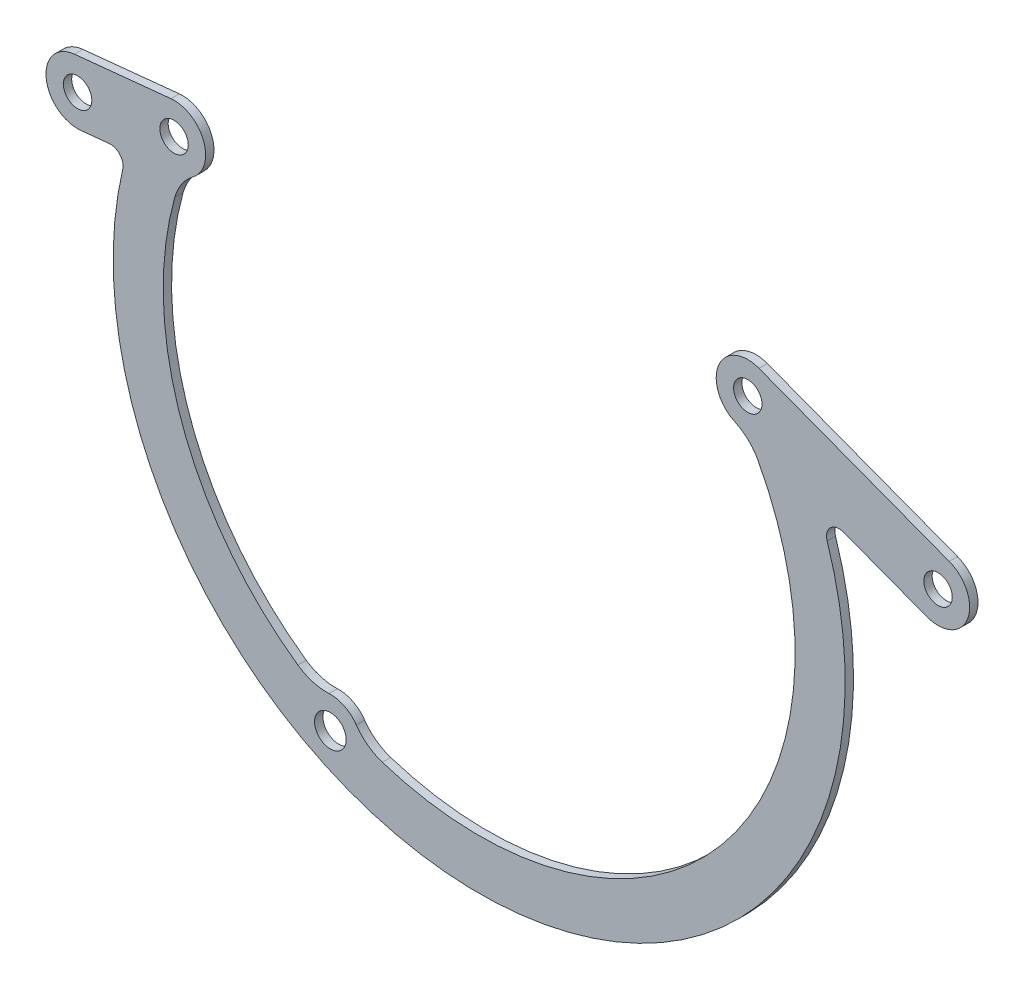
ISO-10303-21;
HEADER;
FILE_DESCRIPTION(('STEP AP214'),'2;1');
FILE_NAME('part.step','',(''),(''),'','','');
FILE_SCHEMA(('AUTOMOTIVE_DESIGN { 1 0 10303 214 1 1 1 1 }'));
ENDSEC;
DATA;
#1=APPLICATION_CONTEXT('core data for automotive mechanical design processes');
#2=APPLICATION_PROTOCOL_DEFINITION('international standard','automotive_design',2000,#1);
#3=PRODUCT_CONTEXT('',#1,'mechanical');
#4=PRODUCT('Part','Part','',(#3));
#5=PRODUCT_RELATED_PRODUCT_CATEGORY('part','',(#4));
#6=PRODUCT_DEFINITION_FORMATION('','',#4);
#7=PRODUCT_DEFINITION_CONTEXT('part definition',#1,'design');
#8=PRODUCT_DEFINITION('design','',#6,#7);
#9=PRODUCT_DEFINITION_SHAPE('','',#8);
#10=(LENGTH_UNIT() NAMED_UNIT(*) SI_UNIT(.MILLI.,.METRE.));
#11=(NAMED_UNIT(*) PLANE_ANGLE_UNIT() SI_UNIT($,.RADIAN.));
#12=(NAMED_UNIT(*) SI_UNIT($,.STERADIAN.) SOLID_ANGLE_UNIT());
#13=UNCERTAINTY_MEASURE_WITH_UNIT(LENGTH_MEASURE(1.E-05),#10,'distance_accuracy_value','');
#14=(GEOMETRIC_REPRESENTATION_CONTEXT(3) GLOBAL_UNCERTAINTY_ASSIGNED_CONTEXT((#13)) GLOBAL_UNIT_ASSIGNED_CONTEXT((#10,
#11,#12)) REPRESENTATION_CONTEXT('',''));
#15=CARTESIAN_POINT('',(0.,0.,0.));
#16=DIRECTION('',(0.,0.,1.));
#17=DIRECTION('',(1.,0.,0.));
#18=AXIS2_PLACEMENT_3D('',#15,#16,#17);
#19=CARTESIAN_POINT('',(0.,0.,1.9812));
#20=DIRECTION('',(0.,0.,1.));
#21=DIRECTION('',(1.,0.,0.));
#22=AXIS2_PLACEMENT_3D('',#19,#20,#21);
#23=PLANE('',#22);
#24=CARTESIAN_POINT('',(-144.25,-101.25,1.9812));
#25=DIRECTION('',(0.,0.,1.));
#26=DIRECTION('',(1.,0.,0.));
#27=AXIS2_PLACEMENT_3D('',#24,#25,#26);
#28=CIRCLE('',#27,3.75000000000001);
#29=CARTESIAN_POINT('',(-140.5,-101.25,1.9812));
#30=VERTEX_POINT('',#29);
#31=EDGE_CURVE('E260',#30,#30,#28,.T.);
#32=ORIENTED_EDGE('',*,*,#31,.F.);
#33=EDGE_LOOP('',(#32));
#34=FACE_BOUND('',#33,.T.);
#35=CARTESIAN_POINT('',(-45.1656581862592,17.1076495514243,1.9812));
#36=DIRECTION('',(0.,0.,1.));
#37=DIRECTION('',(1.,0.,0.));
#38=AXIS2_PLACEMENT_3D('',#35,#36,#37);
#39=CIRCLE('',#38,3.375);
#40=CARTESIAN_POINT('',(-41.7906581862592,17.1076495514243,1.9812));
#41=VERTEX_POINT('',#40);
#42=EDGE_CURVE('E295',#41,#41,#39,.T.);
#43=ORIENTED_EDGE('',*,*,#42,.F.);
#44=EDGE_LOOP('',(#43));
#45=FACE_BOUND('',#44,.T.);
#46=CARTESIAN_POINT('',(0.,0.,1.9812));
#47=DIRECTION('',(0.,0.,1.));
#48=DIRECTION('',(1.,0.,0.));
#49=AXIS2_PLACEMENT_3D('',#46,#47,#48);
#50=CIRCLE('',#49,3.375);
#51=CARTESIAN_POINT('',(3.375,0.,1.9812));
#52=VERTEX_POINT('',#51);
#53=EDGE_CURVE('E298',#52,#52,#50,.T.);
#54=ORIENTED_EDGE('',*,*,#53,.F.);
#55=EDGE_LOOP('',(#54));
#56=FACE_BOUND('',#55,.T.);
#57=CARTESIAN_POINT('',(-181.353320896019,2.30357829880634,1.9812));
#58=DIRECTION('',(0.,0.,1.));
#59=DIRECTION('',(1.,0.,0.));
#60=AXIS2_PLACEMENT_3D('',#57,#58,#59);
#61=CIRCLE('',#60,3.37499999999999);
#62=CARTESIAN_POINT('',(-177.978320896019,2.30357829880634,1.9812));
#63=VERTEX_POINT('',#62);
#64=EDGE_CURVE('E301',#63,#63,#61,.T.);
#65=ORIENTED_EDGE('',*,*,#64,.F.);
#66=EDGE_LOOP('',(#65));
#67=FACE_BOUND('',#66,.T.);
#68=CARTESIAN_POINT('',(-204.25,0.,1.9812));
#69=DIRECTION('',(0.,0.,1.));
#70=DIRECTION('',(1.,0.,0.));
#71=AXIS2_PLACEMENT_3D('',#68,#69,#70);
#72=CIRCLE('',#71,3.37499999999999);
#73=CARTESIAN_POINT('',(-200.875,0.,1.9812));
#74=VERTEX_POINT('',#73);
#75=EDGE_CURVE('E304',#74,#74,#72,.T.);
#76=ORIENTED_EDGE('',*,*,#75,.F.);
#77=EDGE_LOOP('',(#76));
#78=FACE_BOUND('',#77,.T.);
#79=CARTESIAN_POINT('',(-169.615597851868,-13.2680580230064,1.9812));
#80=DIRECTION('',(0.,0.,1.));
#81=DIRECTION('',(1.,0.,0.));
#82=AXIS2_PLACEMENT_3D('',#79,#80,#81);
#83=CIRCLE('',#82,12.);
#84=CARTESIAN_POINT('',(-181.175718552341,-10.0488019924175,1.9812));
#85=VERTEX_POINT('',#84);
#86=CARTESIAN_POINT('',(-176.838812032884,-3.68551259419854,1.9812));
#87=VERTEX_POINT('',#86);
#88=EDGE_CURVE('E221',#85,#87,#83,.F.);
#89=ORIENTED_EDGE('',*,*,#88,.T.);
#90=CARTESIAN_POINT('',(-181.353320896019,2.30357829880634,1.9812));
#91=DIRECTION('',(0.,0.,1.));
#92=DIRECTION('',(1.,0.,0.));
#93=AXIS2_PLACEMENT_3D('',#90,#91,#92);
#94=CIRCLE('',#93,7.5);
#95=CARTESIAN_POINT('',(-182.10408734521,9.76590700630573,1.9812));
#96=VERTEX_POINT('',#95);
#97=EDGE_CURVE('E273',#87,#96,#94,.T.);
#98=ORIENTED_EDGE('',*,*,#97,.T.);
#99=DIRECTION('',(0.994977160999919,0.100102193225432,0.));
#100=VECTOR('',#99,1.);
#101=CARTESIAN_POINT('',(-2.79744317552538,27.805505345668,1.9812));
#102=LINE('',#101,#100);
#103=CARTESIAN_POINT('',(-205.000766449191,7.46232870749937,1.9812));
#104=VERTEX_POINT('',#103);
#105=EDGE_CURVE('E275',#104,#96,#102,.T.);
#106=ORIENTED_EDGE('',*,*,#105,.F.);
#107=CARTESIAN_POINT('',(-204.25,0.,1.9812));
#108=DIRECTION('',(0.,0.,1.));
#109=DIRECTION('',(1.,0.,0.));
#110=AXIS2_PLACEMENT_3D('',#107,#108,#109);
#111=CIRCLE('',#110,7.5);
#112=CARTESIAN_POINT('',(-203.499233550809,-7.46232870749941,1.9812));
#113=VERTEX_POINT('',#112);
#114=EDGE_CURVE('E279',#104,#113,#111,.T.);
#115=ORIENTED_EDGE('',*,*,#114,.T.);
#116=DIRECTION('',(0.994977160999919,0.100102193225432,0.));
#117=VECTOR('',#116,1.);
#118=CARTESIAN_POINT('',(-1.2959102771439,12.8808479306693,1.9812));
#119=LINE('',#118,#117);
#120=CARTESIAN_POINT('',(-196.754027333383,-6.78371017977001,1.9812));
#121=VERTEX_POINT('',#120);
#122=EDGE_CURVE('E281',#113,#121,#119,.T.);
#123=ORIENTED_EDGE('',*,*,#122,.T.);
#124=CARTESIAN_POINT('',(-196.453720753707,-9.76864166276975,1.9812));
#125=DIRECTION('',(0.,0.,1.));
#126=DIRECTION('',(1.,0.,0.));
#127=AXIS2_PLACEMENT_3D('',#124,#125,#126);
#128=CIRCLE('',#127,3.);
#129=CARTESIAN_POINT('',(-193.532028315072,-10.4496066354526,1.9812));
#130=VERTEX_POINT('',#129);
#131=EDGE_CURVE('E366',#121,#130,#128,.F.);
#132=ORIENTED_EDGE('',*,*,#131,.T.);
#133=CARTESIAN_POINT('',(-108.924964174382,-30.1691521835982,1.9812));
#134=DIRECTION('',(0.,0.,1.));
#135=DIRECTION('',(1.,0.,0.));
#136=AXIS2_PLACEMENT_3D('',#133,#134,#135);
#137=CIRCLE('',#136,86.8747131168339);
#138=CARTESIAN_POINT('',(-26.3202312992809,-3.26796474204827,1.9812));
#139=VERTEX_POINT('',#138);
#140=EDGE_CURVE('E284',#130,#139,#137,.T.);
#141=ORIENTED_EDGE('',*,*,#140,.T.);
#142=CARTESIAN_POINT('',(-23.4676843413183,-2.33899980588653,1.9812));
#143=DIRECTION('',(0.,0.,1.));
#144=DIRECTION('',(1.,0.,0.));
#145=AXIS2_PLACEMENT_3D('',#142,#143,#144);
#146=CIRCLE('',#145,3.);
#147=CARTESIAN_POINT('',(-22.4050332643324,0.466489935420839,1.9812));
#148=VERTEX_POINT('',#147);
#149=EDGE_CURVE('E12',#139,#148,#146,.F.);
#150=ORIENTED_EDGE('',*,*,#149,.T.);
#151=DIRECTION('',(0.935163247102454,-0.354217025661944,0.));
#152=VECTOR('',#151,1.);
#153=CARTESIAN_POINT('',(-2.65662769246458,-7.01372435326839,1.9812));
#154=LINE('',#153,#152);
#155=CARTESIAN_POINT('',(-2.65662769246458,-7.01372435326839,1.9812));
#156=VERTEX_POINT('',#155);
#157=EDGE_CURVE('E286',#148,#156,#154,.T.);
#158=ORIENTED_EDGE('',*,*,#157,.T.);
#159=CARTESIAN_POINT('',(0.,0.,1.9812));
#160=DIRECTION('',(0.,0.,1.));
#161=DIRECTION('',(1.,0.,0.));
#162=AXIS2_PLACEMENT_3D('',#159,#160,#161);
#163=CIRCLE('',#162,7.49999999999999);
#164=CARTESIAN_POINT('',(2.65662769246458,7.0137243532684,1.9812));
#165=VERTEX_POINT('',#164);
#166=EDGE_CURVE('E288',#156,#165,#163,.T.);
#167=ORIENTED_EDGE('',*,*,#166,.T.);
#168=DIRECTION('',(0.935163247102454,-0.354217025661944,0.));
#169=VECTOR('',#168,1.);
#170=CARTESIAN_POINT('',(2.65662769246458,7.0137243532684,1.9812));
#171=LINE('',#170,#169);
#172=CARTESIAN_POINT('',(-42.5090304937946,24.1213739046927,1.9812));
#173=VERTEX_POINT('',#172);
#174=EDGE_CURVE('E290',#173,#165,#171,.T.);
#175=ORIENTED_EDGE('',*,*,#174,.F.);
#176=CARTESIAN_POINT('',(-45.1656581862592,17.1076495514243,1.9812));
#177=DIRECTION('',(0.,0.,1.));
#178=DIRECTION('',(1.,0.,0.));
#179=AXIS2_PLACEMENT_3D('',#176,#177,#178);
#180=CIRCLE('',#179,7.49999999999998);
#181=CARTESIAN_POINT('',(-48.2878584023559,10.2884218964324,1.9812));
#182=VERTEX_POINT('',#181);
#183=EDGE_CURVE('E293',#173,#182,#180,.T.);
#184=ORIENTED_EDGE('',*,*,#183,.T.);
#185=CARTESIAN_POINT('',(-53.2833787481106,-0.62234235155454,1.9812));
#186=DIRECTION('',(0.,0.,1.));
#187=DIRECTION('',(1.,0.,0.));
#188=AXIS2_PLACEMENT_3D('',#185,#186,#187);
#189=CIRCLE('',#188,12.);
#190=CARTESIAN_POINT('',(-42.6849815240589,5.0056214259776,1.9812));
#191=VERTEX_POINT('',#190);
#192=EDGE_CURVE('E232',#182,#191,#189,.F.);
#193=ORIENTED_EDGE('',*,*,#192,.T.);
#194=CARTESIAN_POINT('',(-108.924964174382,-30.1691521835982,1.9812));
#195=DIRECTION('',(0.,0.,1.));
#196=DIRECTION('',(1.,0.,0.));
#197=AXIS2_PLACEMENT_3D('',#194,#195,#196);
#198=CIRCLE('',#197,75.);
#199=CARTESIAN_POINT('',(-131.900317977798,-101.563361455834,1.9812));
#200=VERTEX_POINT('',#199);
#201=EDGE_CURVE('E240',#200,#191,#198,.T.);
#202=ORIENTED_EDGE('',*,*,#201,.F.);
#203=CARTESIAN_POINT('',(-128.224261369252,-90.1402879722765,1.9812));
#204=DIRECTION('',(0.,0.,1.));
#205=DIRECTION('',(1.,0.,0.));
#206=AXIS2_PLACEMENT_3D('',#203,#204,#205);
#207=CIRCLE('',#206,12.);
#208=CARTESIAN_POINT('',(-138.086254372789,-96.9770338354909,1.9812));
#209=VERTEX_POINT('',#208);
#210=EDGE_CURVE('E253',#209,#200,#207,.T.);
#211=ORIENTED_EDGE('',*,*,#210,.F.);
#212=CARTESIAN_POINT('',(-144.25,-101.25,1.9812));
#213=DIRECTION('',(0.,0.,1.));
#214=DIRECTION('',(1.,0.,0.));
#215=AXIS2_PLACEMENT_3D('',#212,#213,#214);
#216=CIRCLE('',#215,7.49999999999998);
#217=CARTESIAN_POINT('',(-144.566251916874,-93.7566706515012,1.9812));
#218=VERTEX_POINT('',#217);
#219=EDGE_CURVE('E251',#209,#218,#216,.T.);
#220=ORIENTED_EDGE('',*,*,#219,.T.);
#221=CARTESIAN_POINT('',(-145.072254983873,-81.7673436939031,1.9812));
#222=DIRECTION('',(0.,0.,1.));
#223=DIRECTION('',(1.,0.,0.));
#224=AXIS2_PLACEMENT_3D('',#221,#222,#223);
#225=CIRCLE('',#224,12.);
#226=CARTESIAN_POINT('',(-151.957453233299,-91.5955706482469,1.9812));
#227=VERTEX_POINT('',#226);
#228=EDGE_CURVE('E224',#227,#218,#225,.T.);
#229=ORIENTED_EDGE('',*,*,#228,.F.);
#230=CARTESIAN_POINT('',(-108.924964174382,-30.1691521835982,1.9812));
#231=DIRECTION('',(0.,0.,1.));
#232=DIRECTION('',(1.,0.,0.));
#233=AXIS2_PLACEMENT_3D('',#230,#231,#232);
#234=CIRCLE('',#233,75.);
#235=EDGE_CURVE('E204',#85,#227,#234,.T.);
#236=ORIENTED_EDGE('',*,*,#235,.F.);
#237=EDGE_LOOP('',(#89,#98,#106,#115,#123,#132,#141,#150,#158,#167,#175,#184,#193,#202,#211,
#220,#229,#236));
#238=FACE_BOUND('',#237,.T.);
#239=ADVANCED_FACE('F73',(#34,#45,#56,#67,#78,#238),#23,.T.);
#240=CARTESIAN_POINT('',(0.,0.,0.));
#241=DIRECTION('',(0.,0.,1.));
#242=DIRECTION('',(1.,0.,0.));
#243=AXIS2_PLACEMENT_3D('',#240,#241,#242);
#244=PLANE('',#243);
#245=CARTESIAN_POINT('',(-144.25,-101.25,0.));
#246=DIRECTION('',(0.,0.,1.));
#247=DIRECTION('',(1.,0.,0.));
#248=AXIS2_PLACEMENT_3D('',#245,#246,#247);
#249=CIRCLE('',#248,3.75000000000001);
#250=CARTESIAN_POINT('',(-140.5,-101.25,0.));
#251=VERTEX_POINT('',#250);
#252=EDGE_CURVE('E267',#251,#251,#249,.T.);
#253=ORIENTED_EDGE('',*,*,#252,.T.);
#254=EDGE_LOOP('',(#253));
#255=FACE_BOUND('',#254,.T.);
#256=CARTESIAN_POINT('',(-45.1656581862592,17.1076495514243,0.));
#257=DIRECTION('',(0.,0.,1.));
#258=DIRECTION('',(1.,0.,0.));
#259=AXIS2_PLACEMENT_3D('',#256,#257,#258);
#260=CIRCLE('',#259,3.375);
#261=CARTESIAN_POINT('',(-41.7906581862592,17.1076495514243,0.));
#262=VERTEX_POINT('',#261);
#263=EDGE_CURVE('E331',#262,#262,#260,.T.);
#264=ORIENTED_EDGE('',*,*,#263,.T.);
#265=EDGE_LOOP('',(#264));
#266=FACE_BOUND('',#265,.T.);
#267=CARTESIAN_POINT('',(0.,0.,0.));
#268=DIRECTION('',(0.,0.,1.));
#269=DIRECTION('',(1.,0.,0.));
#270=AXIS2_PLACEMENT_3D('',#267,#268,#269);
#271=CIRCLE('',#270,3.375);
#272=CARTESIAN_POINT('',(3.375,0.,0.));
#273=VERTEX_POINT('',#272);
#274=EDGE_CURVE('E334',#273,#273,#271,.T.);
#275=ORIENTED_EDGE('',*,*,#274,.T.);
#276=EDGE_LOOP('',(#275));
#277=FACE_BOUND('',#276,.T.);
#278=CARTESIAN_POINT('',(-181.353320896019,2.30357829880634,0.));
#279=DIRECTION('',(0.,0.,1.));
#280=DIRECTION('',(1.,0.,0.));
#281=AXIS2_PLACEMENT_3D('',#278,#279,#280);
#282=CIRCLE('',#281,3.37499999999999);
#283=CARTESIAN_POINT('',(-177.978320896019,2.30357829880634,0.));
#284=VERTEX_POINT('',#283);
#285=EDGE_CURVE('E337',#284,#284,#282,.T.);
#286=ORIENTED_EDGE('',*,*,#285,.T.);
#287=EDGE_LOOP('',(#286));
#288=FACE_BOUND('',#287,.T.);
#289=CARTESIAN_POINT('',(-204.25,0.,0.));
#290=DIRECTION('',(0.,0.,1.));
#291=DIRECTION('',(1.,0.,0.));
#292=AXIS2_PLACEMENT_3D('',#289,#290,#291);
#293=CIRCLE('',#292,3.37499999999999);
#294=CARTESIAN_POINT('',(-200.875,0.,0.));
#295=VERTEX_POINT('',#294);
#296=EDGE_CURVE('E276',#295,#295,#293,.T.);
#297=ORIENTED_EDGE('',*,*,#296,.T.);
#298=EDGE_LOOP('',(#297));
#299=FACE_BOUND('',#298,.T.);
#300=CARTESIAN_POINT('',(-181.353320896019,2.30357829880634,0.));
#301=DIRECTION('',(0.,0.,1.));
#302=DIRECTION('',(1.,0.,0.));
#303=AXIS2_PLACEMENT_3D('',#300,#301,#302);
#304=CIRCLE('',#303,7.5);
#305=CARTESIAN_POINT('',(-176.838812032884,-3.68551259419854,0.));
#306=VERTEX_POINT('',#305);
#307=CARTESIAN_POINT('',(-182.10408734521,9.76590700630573,0.));
#308=VERTEX_POINT('',#307);
#309=EDGE_CURVE('E270',#306,#308,#304,.T.);
#310=ORIENTED_EDGE('',*,*,#309,.F.);
#311=CARTESIAN_POINT('',(-169.615597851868,-13.2680580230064,0.));
#312=DIRECTION('',(0.,0.,1.));
#313=DIRECTION('',(1.,0.,0.));
#314=AXIS2_PLACEMENT_3D('',#311,#312,#313);
#315=CIRCLE('',#314,12.);
#316=CARTESIAN_POINT('',(-181.175718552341,-10.0488019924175,0.));
#317=VERTEX_POINT('',#316);
#318=EDGE_CURVE('E209',#317,#306,#315,.F.);
#319=ORIENTED_EDGE('',*,*,#318,.F.);
#320=CARTESIAN_POINT('',(-108.924964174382,-30.1691521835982,0.));
#321=DIRECTION('',(0.,0.,1.));
#322=DIRECTION('',(1.,0.,0.));
#323=AXIS2_PLACEMENT_3D('',#320,#321,#322);
#324=CIRCLE('',#323,75.);
#325=CARTESIAN_POINT('',(-151.957453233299,-91.5955706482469,0.));
#326=VERTEX_POINT('',#325);
#327=EDGE_CURVE('E201',#317,#326,#324,.T.);
#328=ORIENTED_EDGE('',*,*,#327,.T.);
#329=CARTESIAN_POINT('',(-145.072254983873,-81.7673436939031,0.));
#330=DIRECTION('',(0.,0.,1.));
#331=DIRECTION('',(1.,0.,0.));
#332=AXIS2_PLACEMENT_3D('',#329,#330,#331);
#333=CIRCLE('',#332,12.);
#334=CARTESIAN_POINT('',(-144.566251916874,-93.7566706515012,0.));
#335=VERTEX_POINT('',#334);
#336=EDGE_CURVE('E213',#326,#335,#333,.T.);
#337=ORIENTED_EDGE('',*,*,#336,.T.);
#338=CARTESIAN_POINT('',(-144.25,-101.25,0.));
#339=DIRECTION('',(0.,0.,1.));
#340=DIRECTION('',(1.,0.,0.));
#341=AXIS2_PLACEMENT_3D('',#338,#339,#340);
#342=CIRCLE('',#341,7.49999999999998);
#343=CARTESIAN_POINT('',(-138.086254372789,-96.9770338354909,0.));
#344=VERTEX_POINT('',#343);
#345=EDGE_CURVE('E239',#344,#335,#342,.T.);
#346=ORIENTED_EDGE('',*,*,#345,.F.);
#347=CARTESIAN_POINT('',(-128.224261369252,-90.1402879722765,0.));
#348=DIRECTION('',(0.,0.,1.));
#349=DIRECTION('',(1.,0.,0.));
#350=AXIS2_PLACEMENT_3D('',#347,#348,#349);
#351=CIRCLE('',#350,12.);
#352=CARTESIAN_POINT('',(-131.900317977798,-101.563361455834,0.));
#353=VERTEX_POINT('',#352);
#354=EDGE_CURVE('E242',#344,#353,#351,.T.);
#355=ORIENTED_EDGE('',*,*,#354,.T.);
#356=CARTESIAN_POINT('',(-108.924964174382,-30.1691521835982,0.));
#357=DIRECTION('',(0.,0.,1.));
#358=DIRECTION('',(1.,0.,0.));
#359=AXIS2_PLACEMENT_3D('',#356,#357,#358);
#360=CIRCLE('',#359,75.);
#361=CARTESIAN_POINT('',(-42.6849815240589,5.0056214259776,0.));
#362=VERTEX_POINT('',#361);
#363=EDGE_CURVE('E245',#353,#362,#360,.T.);
#364=ORIENTED_EDGE('',*,*,#363,.T.);
#365=CARTESIAN_POINT('',(-53.2833787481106,-0.62234235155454,0.));
#366=DIRECTION('',(0.,0.,1.));
#367=DIRECTION('',(1.,0.,0.));
#368=AXIS2_PLACEMENT_3D('',#365,#366,#367);
#369=CIRCLE('',#368,12.);
#370=CARTESIAN_POINT('',(-48.2878584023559,10.2884218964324,0.));
#371=VERTEX_POINT('',#370);
#372=EDGE_CURVE('E237',#371,#362,#369,.F.);
#373=ORIENTED_EDGE('',*,*,#372,.F.);
#374=CARTESIAN_POINT('',(-45.1656581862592,17.1076495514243,0.));
#375=DIRECTION('',(0.,0.,1.));
#376=DIRECTION('',(1.,0.,0.));
#377=AXIS2_PLACEMENT_3D('',#374,#375,#376);
#378=CIRCLE('',#377,7.49999999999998);
#379=CARTESIAN_POINT('',(-42.5090304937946,24.1213739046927,0.));
#380=VERTEX_POINT('',#379);
#381=EDGE_CURVE('E329',#380,#371,#378,.T.);
#382=ORIENTED_EDGE('',*,*,#381,.F.);
#383=DIRECTION('',(0.935163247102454,-0.354217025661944,0.));
#384=VECTOR('',#383,1.);
#385=CARTESIAN_POINT('',(2.65662769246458,7.0137243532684,0.));
#386=LINE('',#385,#384);
#387=CARTESIAN_POINT('',(2.65662769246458,7.0137243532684,0.));
#388=VERTEX_POINT('',#387);
#389=EDGE_CURVE('E326',#380,#388,#386,.T.);
#390=ORIENTED_EDGE('',*,*,#389,.T.);
#391=CARTESIAN_POINT('',(0.,0.,0.));
#392=DIRECTION('',(0.,0.,1.));
#393=DIRECTION('',(1.,0.,0.));
#394=AXIS2_PLACEMENT_3D('',#391,#392,#393);
#395=CIRCLE('',#394,7.49999999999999);
#396=CARTESIAN_POINT('',(-2.65662769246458,-7.01372435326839,0.));
#397=VERTEX_POINT('',#396);
#398=EDGE_CURVE('E323',#397,#388,#395,.T.);
#399=ORIENTED_EDGE('',*,*,#398,.F.);
#400=DIRECTION('',(0.935163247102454,-0.354217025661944,0.));
#401=VECTOR('',#400,1.);
#402=CARTESIAN_POINT('',(-2.65662769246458,-7.01372435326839,0.));
#403=LINE('',#402,#401);
#404=CARTESIAN_POINT('',(-22.4050332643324,0.466489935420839,0.));
#405=VERTEX_POINT('',#404);
#406=EDGE_CURVE('E321',#405,#397,#403,.T.);
#407=ORIENTED_EDGE('',*,*,#406,.F.);
#408=CARTESIAN_POINT('',(-23.4676843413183,-2.33899980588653,0.));
#409=DIRECTION('',(0.,0.,1.));
#410=DIRECTION('',(1.,0.,0.));
#411=AXIS2_PLACEMENT_3D('',#408,#409,#410);
#412=CIRCLE('',#411,3.);
#413=CARTESIAN_POINT('',(-26.3202312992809,-3.26796474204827,0.));
#414=VERTEX_POINT('',#413);
#415=EDGE_CURVE('E81',#405,#414,#412,.T.);
#416=ORIENTED_EDGE('',*,*,#415,.T.);
#417=CARTESIAN_POINT('',(-108.924964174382,-30.1691521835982,0.));
#418=DIRECTION('',(0.,0.,1.));
#419=DIRECTION('',(1.,0.,0.));
#420=AXIS2_PLACEMENT_3D('',#417,#418,#419);
#421=CIRCLE('',#420,86.8747131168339);
#422=CARTESIAN_POINT('',(-193.532028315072,-10.4496066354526,0.));
#423=VERTEX_POINT('',#422);
#424=EDGE_CURVE('E318',#423,#414,#421,.T.);
#425=ORIENTED_EDGE('',*,*,#424,.F.);
#426=CARTESIAN_POINT('',(-196.453720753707,-9.76864166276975,0.));
#427=DIRECTION('',(0.,0.,1.));
#428=DIRECTION('',(1.,0.,0.));
#429=AXIS2_PLACEMENT_3D('',#426,#427,#428);
#430=CIRCLE('',#429,3.);
#431=CARTESIAN_POINT('',(-196.754027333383,-6.78371017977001,0.));
#432=VERTEX_POINT('',#431);
#433=EDGE_CURVE('E364',#423,#432,#430,.T.);
#434=ORIENTED_EDGE('',*,*,#433,.T.);
#435=DIRECTION('',(0.994977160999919,0.100102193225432,0.));
#436=VECTOR('',#435,1.);
#437=CARTESIAN_POINT('',(-1.2959102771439,12.8808479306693,0.));
#438=LINE('',#437,#436);
#439=CARTESIAN_POINT('',(-203.499233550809,-7.46232870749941,0.));
#440=VERTEX_POINT('',#439);
#441=EDGE_CURVE('E315',#440,#432,#438,.T.);
#442=ORIENTED_EDGE('',*,*,#441,.F.);
#443=CARTESIAN_POINT('',(-204.25,0.,0.));
#444=DIRECTION('',(0.,0.,1.));
#445=DIRECTION('',(1.,0.,0.));
#446=AXIS2_PLACEMENT_3D('',#443,#444,#445);
#447=CIRCLE('',#446,7.5);
#448=CARTESIAN_POINT('',(-205.000766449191,7.46232870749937,0.));
#449=VERTEX_POINT('',#448);
#450=EDGE_CURVE('E313',#449,#440,#447,.T.);
#451=ORIENTED_EDGE('',*,*,#450,.F.);
#452=DIRECTION('',(0.994977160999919,0.100102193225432,0.));
#453=VECTOR('',#452,1.);
#454=CARTESIAN_POINT('',(-2.79744317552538,27.805505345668,0.));
#455=LINE('',#454,#453);
#456=EDGE_CURVE('E310',#449,#308,#455,.T.);
#457=ORIENTED_EDGE('',*,*,#456,.T.);
#458=EDGE_LOOP('',(#310,#319,#328,#337,#346,#355,#364,#373,#382,#390,#399,#407,#416,#425,#434,
#442,#451,#457));
#459=FACE_BOUND('',#458,.T.);
#460=ADVANCED_FACE('F219',(#255,#266,#277,#288,#299,#459),#244,.F.);
#461=CARTESIAN_POINT('',(-181.353320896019,2.30357829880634,1.9812));
#462=DIRECTION('',(0.,0.,-1.));
#463=DIRECTION('',(-1.,0.,0.));
#464=AXIS2_PLACEMENT_3D('',#461,#462,#463);
#465=CYLINDRICAL_SURFACE('',#464,7.5);
#466=ORIENTED_EDGE('',*,*,#309,.T.);
#467=DIRECTION('',(0.,0.,-1.));
#468=VECTOR('',#467,1.);
#469=CARTESIAN_POINT('',(-182.10408734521,9.76590700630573,1.9812));
#470=LINE('',#469,#468);
#471=EDGE_CURVE('E353',#96,#308,#470,.T.);
#472=ORIENTED_EDGE('',*,*,#471,.F.);
#473=ORIENTED_EDGE('',*,*,#97,.F.);
#474=DIRECTION('',(0.,0.,1.));
#475=VECTOR('',#474,1.);
#476=CARTESIAN_POINT('',(-176.838812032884,-3.68551259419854,0.));
#477=LINE('',#476,#475);
#478=EDGE_CURVE('E233',#306,#87,#477,.T.);
#479=ORIENTED_EDGE('',*,*,#478,.F.);
#480=EDGE_LOOP('',(#466,#472,#473,#479));
#481=FACE_BOUND('',#480,.T.);
#482=ADVANCED_FACE('F422',(#481),#465,.T.);
#483=CARTESIAN_POINT('',(-2.79744317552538,27.805505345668,1.9812));
#484=DIRECTION('',(-0.100102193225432,0.994977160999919,0.));
#485=DIRECTION('',(-0.994977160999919,-0.100102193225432,0.));
#486=AXIS2_PLACEMENT_3D('',#483,#484,#485);
#487=PLANE('',#486);
#488=ORIENTED_EDGE('',*,*,#456,.F.);
#489=DIRECTION('',(0.,0.,-1.));
#490=VECTOR('',#489,1.);
#491=CARTESIAN_POINT('',(-205.000766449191,7.46232870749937,1.9812));
#492=LINE('',#491,#490);
#493=EDGE_CURVE('E351',#104,#449,#492,.T.);
#494=ORIENTED_EDGE('',*,*,#493,.F.);
#495=ORIENTED_EDGE('',*,*,#105,.T.);
#496=ORIENTED_EDGE('',*,*,#471,.T.);
#497=EDGE_LOOP('',(#488,#494,#495,#496));
#498=FACE_BOUND('',#497,.T.);
#499=ADVANCED_FACE('F464',(#498),#487,.T.);
#500=CARTESIAN_POINT('',(-204.25,0.,1.9812));
#501=DIRECTION('',(0.,0.,-1.));
#502=DIRECTION('',(-1.,0.,0.));
#503=AXIS2_PLACEMENT_3D('',#500,#501,#502);
#504=CYLINDRICAL_SURFACE('',#503,7.5);
#505=ORIENTED_EDGE('',*,*,#450,.T.);
#506=DIRECTION('',(0.,0.,-1.));
#507=VECTOR('',#506,1.);
#508=CARTESIAN_POINT('',(-203.499233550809,-7.46232870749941,1.9812));
#509=LINE('',#508,#507);
#510=EDGE_CURVE('E348',#113,#440,#509,.T.);
#511=ORIENTED_EDGE('',*,*,#510,.F.);
#512=ORIENTED_EDGE('',*,*,#114,.F.);
#513=ORIENTED_EDGE('',*,*,#493,.T.);
#514=EDGE_LOOP('',(#505,#511,#512,#513));
#515=FACE_BOUND('',#514,.T.);
#516=ADVANCED_FACE('F460',(#515),#504,.T.);
#517=CARTESIAN_POINT('',(-1.2959102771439,12.8808479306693,1.9812));
#518=DIRECTION('',(-0.100102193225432,0.994977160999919,0.));
#519=DIRECTION('',(-0.994977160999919,-0.100102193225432,0.));
#520=AXIS2_PLACEMENT_3D('',#517,#518,#519);
#521=PLANE('',#520);
#522=ORIENTED_EDGE('',*,*,#441,.T.);
#523=DIRECTION('',(0.,0.,1.));
#524=VECTOR('',#523,1.);
#525=CARTESIAN_POINT('',(-196.754027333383,-6.78371017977,1.9812));
#526=LINE('',#525,#524);
#527=EDGE_CURVE('E360',#432,#121,#526,.T.);
#528=ORIENTED_EDGE('',*,*,#527,.T.);
#529=ORIENTED_EDGE('',*,*,#122,.F.);
#530=ORIENTED_EDGE('',*,*,#510,.T.);
#531=EDGE_LOOP('',(#522,#528,#529,#530));
#532=FACE_BOUND('',#531,.T.);
#533=ADVANCED_FACE('F457',(#532),#521,.F.);
#534=CARTESIAN_POINT('',(-108.924964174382,-30.1691521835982,1.9812));
#535=DIRECTION('',(0.,0.,-1.));
#536=DIRECTION('',(-1.,0.,0.));
#537=AXIS2_PLACEMENT_3D('',#534,#535,#536);
#538=CYLINDRICAL_SURFACE('',#537,86.8747131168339);
#539=ORIENTED_EDGE('',*,*,#140,.F.);
#540=DIRECTION('',(0.,0.,-1.));
#541=VECTOR('',#540,1.);
#542=CARTESIAN_POINT('',(-193.532028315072,-10.4496066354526,1.9812));
#543=LINE('',#542,#541);
#544=EDGE_CURVE('E357',#130,#423,#543,.T.);
#545=ORIENTED_EDGE('',*,*,#544,.T.);
#546=ORIENTED_EDGE('',*,*,#424,.T.);
#547=DIRECTION('',(0.,0.,-1.));
#548=VECTOR('',#547,1.);
#549=CARTESIAN_POINT('',(-26.3202312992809,-3.26796474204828,1.9812));
#550=LINE('',#549,#548);
#551=EDGE_CURVE('E355',#414,#139,#550,.F.);
#552=ORIENTED_EDGE('',*,*,#551,.T.);
#553=EDGE_LOOP('',(#539,#545,#546,#552));
#554=FACE_BOUND('',#553,.T.);
#555=ADVANCED_FACE('F372',(#554),#538,.T.);
#556=CARTESIAN_POINT('',(-2.65662769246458,-7.01372435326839,1.9812));
#557=DIRECTION('',(0.354217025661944,0.935163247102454,0.));
#558=DIRECTION('',(-0.935163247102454,0.354217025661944,0.));
#559=AXIS2_PLACEMENT_3D('',#556,#557,#558);
#560=PLANE('',#559);
#561=ORIENTED_EDGE('',*,*,#157,.F.);
#562=DIRECTION('',(0.,0.,1.));
#563=VECTOR('',#562,1.);
#564=CARTESIAN_POINT('',(-22.4050332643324,0.466489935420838,0.));
#565=LINE('',#564,#563);
#566=EDGE_CURVE('E362',#148,#405,#565,.F.);
#567=ORIENTED_EDGE('',*,*,#566,.T.);
#568=ORIENTED_EDGE('',*,*,#406,.T.);
#569=DIRECTION('',(0.,0.,-1.));
#570=VECTOR('',#569,1.);
#571=CARTESIAN_POINT('',(-2.65662769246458,-7.01372435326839,1.9812));
#572=LINE('',#571,#570);
#573=EDGE_CURVE('E345',#156,#397,#572,.T.);
#574=ORIENTED_EDGE('',*,*,#573,.F.);
#575=EDGE_LOOP('',(#561,#567,#568,#574));
#576=FACE_BOUND('',#575,.T.);
#577=ADVANCED_FACE('F375',(#576),#560,.F.);
#578=CARTESIAN_POINT('',(0.,0.,1.9812));
#579=DIRECTION('',(0.,0.,-1.));
#580=DIRECTION('',(-1.,0.,0.));
#581=AXIS2_PLACEMENT_3D('',#578,#579,#580);
#582=CYLINDRICAL_SURFACE('',#581,7.49999999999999);
#583=ORIENTED_EDGE('',*,*,#398,.T.);
#584=DIRECTION('',(0.,0.,-1.));
#585=VECTOR('',#584,1.);
#586=CARTESIAN_POINT('',(2.65662769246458,7.0137243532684,1.9812));
#587=LINE('',#586,#585);
#588=EDGE_CURVE('E343',#165,#388,#587,.T.);
#589=ORIENTED_EDGE('',*,*,#588,.F.);
#590=ORIENTED_EDGE('',*,*,#166,.F.);
#591=ORIENTED_EDGE('',*,*,#573,.T.);
#592=EDGE_LOOP('',(#583,#589,#590,#591));
#593=FACE_BOUND('',#592,.T.);
#594=ADVANCED_FACE('F381',(#593),#582,.T.);
#595=CARTESIAN_POINT('',(2.65662769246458,7.0137243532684,1.9812));
#596=DIRECTION('',(0.354217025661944,0.935163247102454,0.));
#597=DIRECTION('',(-0.935163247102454,0.354217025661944,0.));
#598=AXIS2_PLACEMENT_3D('',#595,#596,#597);
#599=PLANE('',#598);
#600=ORIENTED_EDGE('',*,*,#389,.F.);
#601=DIRECTION('',(0.,0.,-1.));
#602=VECTOR('',#601,1.);
#603=CARTESIAN_POINT('',(-42.5090304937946,24.1213739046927,1.9812));
#604=LINE('',#603,#602);
#605=EDGE_CURVE('E307',#173,#380,#604,.T.);
#606=ORIENTED_EDGE('',*,*,#605,.F.);
#607=ORIENTED_EDGE('',*,*,#174,.T.);
#608=ORIENTED_EDGE('',*,*,#588,.T.);
#609=EDGE_LOOP('',(#600,#606,#607,#608));
#610=FACE_BOUND('',#609,.T.);
#611=ADVANCED_FACE('F384',(#610),#599,.T.);
#612=CARTESIAN_POINT('',(-181.353320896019,2.30357829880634,1.9812));
#613=DIRECTION('',(0.,0.,-1.));
#614=DIRECTION('',(-1.,0.,0.));
#615=AXIS2_PLACEMENT_3D('',#612,#613,#614);
#616=CYLINDRICAL_SURFACE('',#615,3.37499999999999);
#617=ORIENTED_EDGE('',*,*,#64,.T.);
#618=EDGE_LOOP('',(#617));
#619=FACE_BOUND('',#618,.T.);
#620=ORIENTED_EDGE('',*,*,#285,.F.);
#621=EDGE_LOOP('',(#620));
#622=FACE_BOUND('',#621,.T.);
#623=ADVANCED_FACE('F435',(#619,#622),#616,.F.);
#624=CARTESIAN_POINT('',(0.,0.,1.9812));
#625=DIRECTION('',(0.,0.,-1.));
#626=DIRECTION('',(-1.,0.,0.));
#627=AXIS2_PLACEMENT_3D('',#624,#625,#626);
#628=CYLINDRICAL_SURFACE('',#627,3.375);
#629=ORIENTED_EDGE('',*,*,#53,.T.);
#630=EDGE_LOOP('',(#629));
#631=FACE_BOUND('',#630,.T.);
#632=ORIENTED_EDGE('',*,*,#274,.F.);
#633=EDGE_LOOP('',(#632));
#634=FACE_BOUND('',#633,.T.);
#635=ADVANCED_FACE('F438',(#631,#634),#628,.F.);
#636=CARTESIAN_POINT('',(-45.1656581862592,17.1076495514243,1.9812));
#637=DIRECTION('',(0.,0.,-1.));
#638=DIRECTION('',(-1.,0.,0.));
#639=AXIS2_PLACEMENT_3D('',#636,#637,#638);
#640=CYLINDRICAL_SURFACE('',#639,3.375);
#641=ORIENTED_EDGE('',*,*,#42,.T.);
#642=EDGE_LOOP('',(#641));
#643=FACE_BOUND('',#642,.T.);
#644=ORIENTED_EDGE('',*,*,#263,.F.);
#645=EDGE_LOOP('',(#644));
#646=FACE_BOUND('',#645,.T.);
#647=ADVANCED_FACE('F442',(#643,#646),#640,.F.);
#648=CARTESIAN_POINT('',(-45.1656581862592,17.1076495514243,1.9812));
#649=DIRECTION('',(0.,0.,-1.));
#650=DIRECTION('',(-1.,0.,0.));
#651=AXIS2_PLACEMENT_3D('',#648,#649,#650);
#652=CYLINDRICAL_SURFACE('',#651,7.49999999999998);
#653=ORIENTED_EDGE('',*,*,#381,.T.);
#654=DIRECTION('',(0.,0.,1.));
#655=VECTOR('',#654,1.);
#656=CARTESIAN_POINT('',(-48.2878584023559,10.2884218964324,0.));
#657=LINE('',#656,#655);
#658=EDGE_CURVE('E248',#371,#182,#657,.T.);
#659=ORIENTED_EDGE('',*,*,#658,.T.);
#660=ORIENTED_EDGE('',*,*,#183,.F.);
#661=ORIENTED_EDGE('',*,*,#605,.T.);
#662=EDGE_LOOP('',(#653,#659,#660,#661));
#663=FACE_BOUND('',#662,.T.);
#664=ADVANCED_FACE('F388',(#663),#652,.T.);
#665=CARTESIAN_POINT('',(-204.25,0.,1.9812));
#666=DIRECTION('',(0.,0.,-1.));
#667=DIRECTION('',(-1.,0.,0.));
#668=AXIS2_PLACEMENT_3D('',#665,#666,#667);
#669=CYLINDRICAL_SURFACE('',#668,3.37499999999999);
#670=ORIENTED_EDGE('',*,*,#75,.T.);
#671=EDGE_LOOP('',(#670));
#672=FACE_BOUND('',#671,.T.);
#673=ORIENTED_EDGE('',*,*,#296,.F.);
#674=EDGE_LOOP('',(#673));
#675=FACE_BOUND('',#674,.T.);
#676=ADVANCED_FACE('F430',(#672,#675),#669,.F.);
#677=CARTESIAN_POINT('',(-196.453720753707,-9.76864166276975,1.9812));
#678=DIRECTION('',(0.,0.,-1.));
#679=DIRECTION('',(-1.,0.,0.));
#680=AXIS2_PLACEMENT_3D('',#677,#678,#679);
#681=CYLINDRICAL_SURFACE('',#680,3.);
#682=ORIENTED_EDGE('',*,*,#131,.F.);
#683=ORIENTED_EDGE('',*,*,#527,.F.);
#684=ORIENTED_EDGE('',*,*,#433,.F.);
#685=ORIENTED_EDGE('',*,*,#544,.F.);
#686=EDGE_LOOP('',(#682,#683,#684,#685));
#687=FACE_BOUND('',#686,.T.);
#688=ADVANCED_FACE('F433',(#687),#681,.F.);
#689=CARTESIAN_POINT('',(-23.4676843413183,-2.33899980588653,1.9812));
#690=DIRECTION('',(0.,0.,-1.));
#691=DIRECTION('',(-1.,0.,0.));
#692=AXIS2_PLACEMENT_3D('',#689,#690,#691);
#693=CYLINDRICAL_SURFACE('',#692,3.);
#694=ORIENTED_EDGE('',*,*,#149,.F.);
#695=ORIENTED_EDGE('',*,*,#551,.F.);
#696=ORIENTED_EDGE('',*,*,#415,.F.);
#697=ORIENTED_EDGE('',*,*,#566,.F.);
#698=EDGE_LOOP('',(#694,#695,#696,#697));
#699=FACE_BOUND('',#698,.T.);
#700=ADVANCED_FACE('F75',(#699),#693,.F.);
#701=CARTESIAN_POINT('',(-144.25,-101.25,0.));
#702=DIRECTION('',(0.,0.,1.));
#703=DIRECTION('',(1.,0.,0.));
#704=AXIS2_PLACEMENT_3D('',#701,#702,#703);
#705=CYLINDRICAL_SURFACE('',#704,3.75000000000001);
#706=ORIENTED_EDGE('',*,*,#252,.F.);
#707=EDGE_LOOP('',(#706));
#708=FACE_BOUND('',#707,.T.);
#709=ORIENTED_EDGE('',*,*,#31,.T.);
#710=EDGE_LOOP('',(#709));
#711=FACE_BOUND('',#710,.T.);
#712=ADVANCED_FACE('F428',(#708,#711),#705,.F.);
#713=CARTESIAN_POINT('',(-53.2833787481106,-0.62234235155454,0.));
#714=DIRECTION('',(0.,0.,1.));
#715=DIRECTION('',(1.,0.,0.));
#716=AXIS2_PLACEMENT_3D('',#713,#714,#715);
#717=CYLINDRICAL_SURFACE('',#716,12.);
#718=ORIENTED_EDGE('',*,*,#192,.F.);
#719=ORIENTED_EDGE('',*,*,#658,.F.);
#720=ORIENTED_EDGE('',*,*,#372,.T.);
#721=DIRECTION('',(0.,0.,1.));
#722=VECTOR('',#721,1.);
#723=CARTESIAN_POINT('',(-42.6849815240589,5.0056214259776,0.));
#724=LINE('',#723,#722);
#725=EDGE_CURVE('E258',#362,#191,#724,.T.);
#726=ORIENTED_EDGE('',*,*,#725,.T.);
#727=EDGE_LOOP('',(#718,#719,#720,#726));
#728=FACE_BOUND('',#727,.T.);
#729=ADVANCED_FACE('F394',(#728),#717,.F.);
#730=CARTESIAN_POINT('',(-108.924964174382,-30.1691521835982,0.));
#731=DIRECTION('',(0.,0.,1.));
#732=DIRECTION('',(1.,0.,0.));
#733=AXIS2_PLACEMENT_3D('',#730,#731,#732);
#734=CYLINDRICAL_SURFACE('',#733,75.);
#735=ORIENTED_EDGE('',*,*,#201,.T.);
#736=ORIENTED_EDGE('',*,*,#725,.F.);
#737=ORIENTED_EDGE('',*,*,#363,.F.);
#738=DIRECTION('',(0.,0.,1.));
#739=VECTOR('',#738,1.);
#740=CARTESIAN_POINT('',(-131.900317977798,-101.563361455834,0.));
#741=LINE('',#740,#739);
#742=EDGE_CURVE('E261',#353,#200,#741,.T.);
#743=ORIENTED_EDGE('',*,*,#742,.T.);
#744=EDGE_LOOP('',(#735,#736,#737,#743));
#745=FACE_BOUND('',#744,.T.);
#746=ADVANCED_FACE('F399',(#745),#734,.F.);
#747=CARTESIAN_POINT('',(-128.224261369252,-90.1402879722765,0.));
#748=DIRECTION('',(0.,0.,1.));
#749=DIRECTION('',(1.,0.,0.));
#750=AXIS2_PLACEMENT_3D('',#747,#748,#749);
#751=CYLINDRICAL_SURFACE('',#750,12.);
#752=ORIENTED_EDGE('',*,*,#210,.T.);
#753=ORIENTED_EDGE('',*,*,#742,.F.);
#754=ORIENTED_EDGE('',*,*,#354,.F.);
#755=DIRECTION('',(0.,0.,1.));
#756=VECTOR('',#755,1.);
#757=CARTESIAN_POINT('',(-138.086254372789,-96.9770338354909,0.));
#758=LINE('',#757,#756);
#759=EDGE_CURVE('E263',#344,#209,#758,.T.);
#760=ORIENTED_EDGE('',*,*,#759,.T.);
#761=EDGE_LOOP('',(#752,#753,#754,#760));
#762=FACE_BOUND('',#761,.T.);
#763=ADVANCED_FACE('F402',(#762),#751,.F.);
#764=CARTESIAN_POINT('',(-144.25,-101.25,0.));
#765=DIRECTION('',(0.,0.,1.));
#766=DIRECTION('',(1.,0.,0.));
#767=AXIS2_PLACEMENT_3D('',#764,#765,#766);
#768=CYLINDRICAL_SURFACE('',#767,7.49999999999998);
#769=ORIENTED_EDGE('',*,*,#219,.F.);
#770=ORIENTED_EDGE('',*,*,#759,.F.);
#771=ORIENTED_EDGE('',*,*,#345,.T.);
#772=DIRECTION('',(0.,0.,1.));
#773=VECTOR('',#772,1.);
#774=CARTESIAN_POINT('',(-144.566251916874,-93.7566706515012,0.));
#775=LINE('',#774,#773);
#776=EDGE_CURVE('E208',#335,#218,#775,.T.);
#777=ORIENTED_EDGE('',*,*,#776,.T.);
#778=EDGE_LOOP('',(#769,#770,#771,#777));
#779=FACE_BOUND('',#778,.T.);
#780=ADVANCED_FACE('F405',(#779),#768,.T.);
#781=CARTESIAN_POINT('',(-108.924964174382,-30.1691521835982,0.));
#782=DIRECTION('',(0.,0.,1.));
#783=DIRECTION('',(1.,0.,0.));
#784=AXIS2_PLACEMENT_3D('',#781,#782,#783);
#785=CYLINDRICAL_SURFACE('',#784,75.);
#786=ORIENTED_EDGE('',*,*,#235,.T.);
#787=DIRECTION('',(0.,0.,1.));
#788=VECTOR('',#787,1.);
#789=CARTESIAN_POINT('',(-151.957453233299,-91.5955706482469,0.));
#790=LINE('',#789,#788);
#791=EDGE_CURVE('E197',#326,#227,#790,.T.);
#792=ORIENTED_EDGE('',*,*,#791,.F.);
#793=ORIENTED_EDGE('',*,*,#327,.F.);
#794=DIRECTION('',(0.,0.,1.));
#795=VECTOR('',#794,1.);
#796=CARTESIAN_POINT('',(-181.175718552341,-10.0488019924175,0.));
#797=LINE('',#796,#795);
#798=EDGE_CURVE('E230',#317,#85,#797,.T.);
#799=ORIENTED_EDGE('',*,*,#798,.T.);
#800=EDGE_LOOP('',(#786,#792,#793,#799));
#801=FACE_BOUND('',#800,.T.);
#802=ADVANCED_FACE('F199',(#801),#785,.F.);
#803=CARTESIAN_POINT('',(-169.615597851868,-13.2680580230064,0.));
#804=DIRECTION('',(0.,0.,1.));
#805=DIRECTION('',(1.,0.,0.));
#806=AXIS2_PLACEMENT_3D('',#803,#804,#805);
#807=CYLINDRICAL_SURFACE('',#806,12.);
#808=ORIENTED_EDGE('',*,*,#88,.F.);
#809=ORIENTED_EDGE('',*,*,#798,.F.);
#810=ORIENTED_EDGE('',*,*,#318,.T.);
#811=ORIENTED_EDGE('',*,*,#478,.T.);
#812=EDGE_LOOP('',(#808,#809,#810,#811));
#813=FACE_BOUND('',#812,.T.);
#814=ADVANCED_FACE('F412',(#813),#807,.F.);
#815=CARTESIAN_POINT('',(-145.072254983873,-81.7673436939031,0.));
#816=DIRECTION('',(0.,0.,1.));
#817=DIRECTION('',(1.,0.,0.));
#818=AXIS2_PLACEMENT_3D('',#815,#816,#817);
#819=CYLINDRICAL_SURFACE('',#818,12.);
#820=ORIENTED_EDGE('',*,*,#228,.T.);
#821=ORIENTED_EDGE('',*,*,#776,.F.);
#822=ORIENTED_EDGE('',*,*,#336,.F.);
#823=ORIENTED_EDGE('',*,*,#791,.T.);
#824=EDGE_LOOP('',(#820,#821,#822,#823));
#825=FACE_BOUND('',#824,.T.);
#826=ADVANCED_FACE('F214',(#825),#819,.F.);
#827=CLOSED_SHELL('',(#239,#460,#482,#499,#516,#533,#555,#577,#594,#611,#623,#635,#647,#664,
#676,#688,#700,#712,#729,#746,#763,#780,#802,#814,#826));
#828=MANIFOLD_SOLID_BREP('B2',#827);
#829=ADVANCED_BREP_SHAPE_REPRESENTATION('',(#18,#828),#14);
#830=SHAPE_DEFINITION_REPRESENTATION(#9,#829);
ENDSEC;
END-ISO-10303-21;
